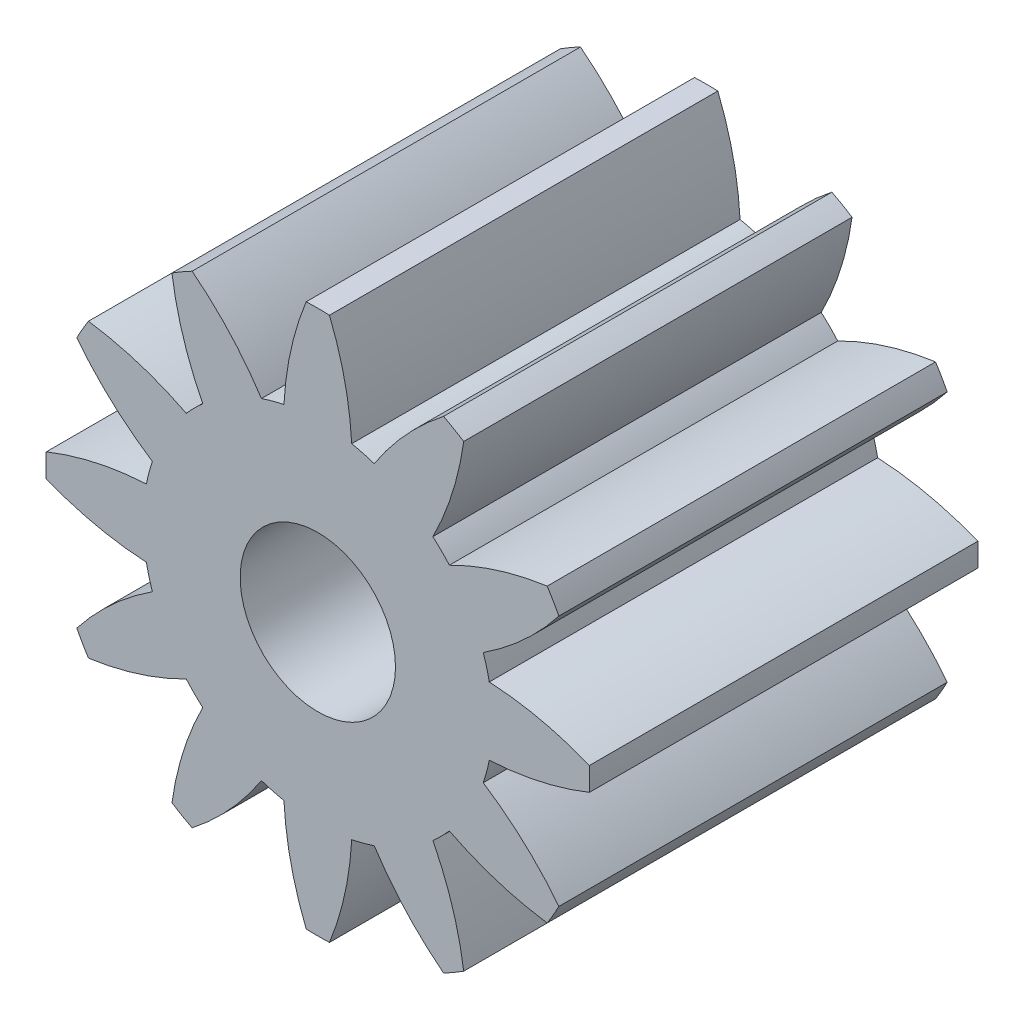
from build123d import *

# Parameters (mm, degrees)
ESQUISSE2_R                  = 3.5
ESQUISSE2_R_2                = 1
BASE_EXTRUSION_DEPTH         = 5
ENL_V_MAT_EXTRU_2_DEPTH      = 8.03562364
R_P_TITION_CIRCULAIRE2_COUNT = 12


with BuildPart() as part:
    # Esquisse2 → Base-Extrusion (new body)
    with BuildSketch(Plane.XY):
        Circle(ESQUISSE2_R)
        Circle(ESQUISSE2_R_2, mode=Mode.SUBTRACT)
    extrude(amount=BASE_EXTRUSION_DEPTH)

    # Esquisse3 → Enl_v. mat.-Extru.2 (cut, through all)
    with BuildSketch(Plane.XY.offset(5)):
        with BuildLine():
            Line((0.582342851, 2.173333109), (1.13871277, 4.249733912))
            Line((1.13871277, 4.249733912), (-1.13871277, 4.249733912))
            Line((-1.13871277, 4.249733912), (-0.582342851, 2.173333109))
            ThreePointArc((-0.582342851, 2.173333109), (-0.509534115, 2.191546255), (-0.436158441, 2.207320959))
            ThreePointArc((-0.436158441, 2.207320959), (-0.346670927, 2.8639457), (-0.15, 3.496784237))
            ThreePointArc((-0.15, 3.496784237), (0, 3.5), (0.15, 3.496784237))
            ThreePointArc((0.15, 3.496784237), (0.346670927, 2.8639457), (0.436158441, 2.207320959))
            ThreePointArc((0.436158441, 2.207320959), (0.509534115, 2.191546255), (0.582342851, 2.173333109))
        make_face()
    enl_v_mat_extru_2 = extrude(amount=-ENL_V_MAT_EXTRU_2_DEPTH, mode=Mode.SUBTRACT)

    # R_p_tition circulaire2: Enl_v. mat.-Extru.2 ×12 about axis
    r_p_tition_circulaire2_axis = Axis((0, 0, 0), (0, 0, -1))
    for i in range(1, R_P_TITION_CIRCULAIRE2_COUNT):
        add(enl_v_mat_extru_2.rotate(r_p_tition_circulaire2_axis, i * 360 / R_P_TITION_CIRCULAIRE2_COUNT), mode=Mode.SUBTRACT)


solid = part.part
